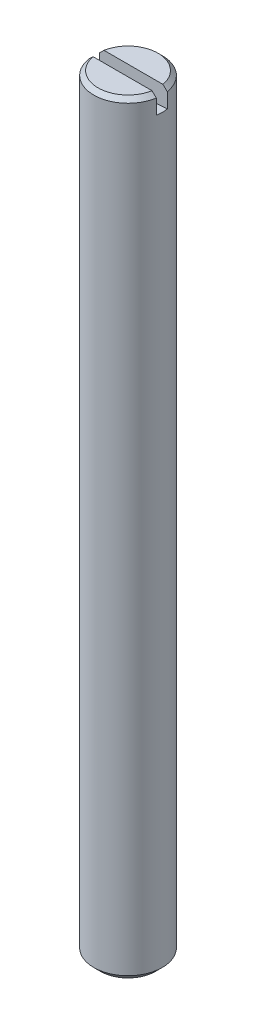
ISO-10303-21;
HEADER;
FILE_DESCRIPTION(('STEP AP214'),'2;1');
FILE_NAME('part.step','',(''),(''),'','','');
FILE_SCHEMA(('AUTOMOTIVE_DESIGN { 1 0 10303 214 1 1 1 1 }'));
ENDSEC;
DATA;
#1=APPLICATION_CONTEXT('core data for automotive mechanical design processes');
#2=APPLICATION_PROTOCOL_DEFINITION('international standard','automotive_design',2000,#1);
#3=PRODUCT_CONTEXT('',#1,'mechanical');
#4=PRODUCT('Part','Part','',(#3));
#5=PRODUCT_RELATED_PRODUCT_CATEGORY('part','',(#4));
#6=PRODUCT_DEFINITION_FORMATION('','',#4);
#7=PRODUCT_DEFINITION_CONTEXT('part definition',#1,'design');
#8=PRODUCT_DEFINITION('design','',#6,#7);
#9=PRODUCT_DEFINITION_SHAPE('','',#8);
#10=(LENGTH_UNIT() NAMED_UNIT(*) SI_UNIT(.MILLI.,.METRE.));
#11=(NAMED_UNIT(*) PLANE_ANGLE_UNIT() SI_UNIT($,.RADIAN.));
#12=(NAMED_UNIT(*) SI_UNIT($,.STERADIAN.) SOLID_ANGLE_UNIT());
#13=UNCERTAINTY_MEASURE_WITH_UNIT(LENGTH_MEASURE(1.E-05),#10,'distance_accuracy_value','');
#14=(GEOMETRIC_REPRESENTATION_CONTEXT(3) GLOBAL_UNCERTAINTY_ASSIGNED_CONTEXT((#13)) GLOBAL_UNIT_ASSIGNED_CONTEXT((#10,
#11,#12)) REPRESENTATION_CONTEXT('',''));
#15=CARTESIAN_POINT('',(0.,0.,0.));
#16=DIRECTION('',(0.,0.,1.));
#17=DIRECTION('',(1.,0.,0.));
#18=AXIS2_PLACEMENT_3D('',#15,#16,#17);
#19=CARTESIAN_POINT('',(0.,36.,0.));
#20=DIRECTION('',(0.,-1.,0.));
#21=DIRECTION('',(0.,0.,-1.));
#22=AXIS2_PLACEMENT_3D('',#19,#20,#21);
#23=PLANE('',#22);
#24=CARTESIAN_POINT('',(0.,36.0000000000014,0.));
#25=DIRECTION('',(0.,-1.,0.));
#26=DIRECTION('',(0.,0.,-1.));
#27=AXIS2_PLACEMENT_3D('',#24,#25,#26);
#28=CIRCLE('',#27,2.19349999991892);
#29=CARTESIAN_POINT('',(-2.15672025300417,35.9999999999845,-0.4));
#30=VERTEX_POINT('',#29);
#31=CARTESIAN_POINT('',(2.15672025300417,35.9999999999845,-0.4));
#32=VERTEX_POINT('',#31);
#33=EDGE_CURVE('E166',#30,#32,#28,.T.);
#34=ORIENTED_EDGE('',*,*,#33,.F.);
#35=DIRECTION('',(1.,0.,0.));
#36=VECTOR('',#35,1.);
#37=CARTESIAN_POINT('',(0.,36.,-0.4));
#38=LINE('',#37,#36);
#39=EDGE_CURVE('E164',#32,#30,#38,.F.);
#40=ORIENTED_EDGE('',*,*,#39,.F.);
#41=EDGE_LOOP('',(#34,#40));
#42=FACE_BOUND('',#41,.T.);
#43=ADVANCED_FACE('F15',(#42),#23,.F.);
#44=CARTESIAN_POINT('',(0.,36.,0.));
#45=DIRECTION('',(0.,-1.,0.));
#46=DIRECTION('',(0.,0.,-1.));
#47=AXIS2_PLACEMENT_3D('',#44,#45,#46);
#48=PLANE('',#47);
#49=DIRECTION('',(1.,0.,0.));
#50=VECTOR('',#49,1.);
#51=CARTESIAN_POINT('',(0.,36.,0.4));
#52=LINE('',#51,#50);
#53=CARTESIAN_POINT('',(-2.15672025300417,35.9999999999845,0.4));
#54=VERTEX_POINT('',#53);
#55=CARTESIAN_POINT('',(2.15672025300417,35.9999999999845,0.4));
#56=VERTEX_POINT('',#55);
#57=EDGE_CURVE('E162',#54,#56,#52,.T.);
#58=ORIENTED_EDGE('',*,*,#57,.F.);
#59=CARTESIAN_POINT('',(0.,36.0000000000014,0.));
#60=DIRECTION('',(0.,-1.,0.));
#61=DIRECTION('',(0.,0.,-1.));
#62=AXIS2_PLACEMENT_3D('',#59,#60,#61);
#63=CIRCLE('',#62,2.19349999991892);
#64=EDGE_CURVE('E160',#56,#54,#63,.T.);
#65=ORIENTED_EDGE('',*,*,#64,.F.);
#66=EDGE_LOOP('',(#58,#65));
#67=FACE_BOUND('',#66,.T.);
#68=ADVANCED_FACE('F122',(#67),#48,.F.);
#69=CARTESIAN_POINT('',(0.,35.6934999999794,0.));
#70=DIRECTION('',(0.,-1.,0.));
#71=DIRECTION('',(0.,0.,-1.));
#72=AXIS2_PLACEMENT_3D('',#69,#70,#71);
#73=CONICAL_SURFACE('',#72,2.49999999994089,0.785398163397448);
#74=CARTESIAN_POINT('',(-2.15672025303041,35.9999999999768,-0.400000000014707));
#75=CARTESIAN_POINT('',(-2.20861576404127,35.9489675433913,-0.400000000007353));
#76=CARTESIAN_POINT('',(-2.26048621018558,35.8979096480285,-0.400000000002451));
#77=CARTESIAN_POINT('',(-2.36417697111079,35.7957429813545,-0.399999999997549));
#78=CARTESIAN_POINT('',(-2.41599728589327,35.7446342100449,-0.399999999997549));
#79=CARTESIAN_POINT('',(-2.46779253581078,35.6934999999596,-0.4));
#80=B_SPLINE_CURVE_WITH_KNOTS('',3,(#74,#75,#76,#77,#78,#79),.UNSPECIFIED.,.F.,.F.,(4,2,4),(0.,
0.218350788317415,0.436701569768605),.UNSPECIFIED.);
#81=CARTESIAN_POINT('',(-2.46779253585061,35.6934999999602,-0.4));
#82=VERTEX_POINT('',#81);
#83=EDGE_CURVE('E40',#30,#82,#80,.T.);
#84=ORIENTED_EDGE('',*,*,#83,.F.);
#85=ORIENTED_EDGE('',*,*,#33,.T.);
#86=CARTESIAN_POINT('',(2.46779253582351,35.6934999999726,-0.400000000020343));
#87=CARTESIAN_POINT('',(2.41599728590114,35.7446342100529,-0.400000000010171));
#88=CARTESIAN_POINT('',(2.36417697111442,35.7957429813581,-0.400000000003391));
#89=CARTESIAN_POINT('',(2.26048621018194,35.8979096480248,-0.39999999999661));
#90=CARTESIAN_POINT('',(2.20861576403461,35.9489675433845,-0.39999999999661));
#91=CARTESIAN_POINT('',(2.15672025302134,35.9999999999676,-0.4));
#92=B_SPLINE_CURVE_WITH_KNOTS('',3,(#86,#87,#88,#89,#90,#91),.UNSPECIFIED.,.F.,.F.,(4,2,4),(0.,
0.218350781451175,0.436701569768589),.UNSPECIFIED.);
#93=CARTESIAN_POINT('',(2.46779253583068,35.6934999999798,-0.4));
#94=VERTEX_POINT('',#93);
#95=EDGE_CURVE('E135',#94,#32,#92,.T.);
#96=ORIENTED_EDGE('',*,*,#95,.F.);
#97=CARTESIAN_POINT('',(0.,35.6935,0.));
#98=DIRECTION('',(0.,-1.,0.));
#99=DIRECTION('',(0.,0.,-1.));
#100=AXIS2_PLACEMENT_3D('',#97,#98,#99);
#101=CIRCLE('',#100,2.5);
#102=EDGE_CURVE('E10',#82,#94,#101,.T.);
#103=ORIENTED_EDGE('',*,*,#102,.F.);
#104=EDGE_LOOP('',(#84,#85,#96,#103));
#105=FACE_BOUND('',#104,.T.);
#106=ADVANCED_FACE('F117',(#105),#73,.T.);
#107=CARTESIAN_POINT('',(0.,66.,-0.4));
#108=DIRECTION('',(0.,0.,1.));
#109=DIRECTION('',(1.,0.,0.));
#110=AXIS2_PLACEMENT_3D('',#107,#108,#109);
#111=PLANE('',#110);
#112=ORIENTED_EDGE('',*,*,#39,.T.);
#113=ORIENTED_EDGE('',*,*,#83,.T.);
#114=DIRECTION('',(0.,1.,0.));
#115=VECTOR('',#114,1.);
#116=CARTESIAN_POINT('',(-2.46779253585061,66.,-0.4));
#117=LINE('',#116,#115);
#118=CARTESIAN_POINT('',(-2.46779253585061,34.596815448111,-0.4));
#119=VERTEX_POINT('',#118);
#120=EDGE_CURVE('E155',#82,#119,#117,.F.);
#121=ORIENTED_EDGE('',*,*,#120,.T.);
#122=CARTESIAN_POINT('',(0.,66.,-0.4));
#123=DIRECTION('',(0.,0.,-1.));
#124=DIRECTION('',(-1.,0.,0.));
#125=AXIS2_PLACEMENT_3D('',#122,#123,#124);
#126=CIRCLE('',#125,31.5);
#127=CARTESIAN_POINT('',(2.46779253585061,34.596815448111,-0.4));
#128=VERTEX_POINT('',#127);
#129=EDGE_CURVE('E89',#119,#128,#126,.F.);
#130=ORIENTED_EDGE('',*,*,#129,.T.);
#131=DIRECTION('',(0.,1.,0.));
#132=VECTOR('',#131,1.);
#133=CARTESIAN_POINT('',(2.46779253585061,66.,-0.4));
#134=LINE('',#133,#132);
#135=EDGE_CURVE('E141',#128,#94,#134,.T.);
#136=ORIENTED_EDGE('',*,*,#135,.T.);
#137=ORIENTED_EDGE('',*,*,#95,.T.);
#138=EDGE_LOOP('',(#112,#113,#121,#130,#136,#137));
#139=FACE_BOUND('',#138,.T.);
#140=ADVANCED_FACE('F121',(#139),#111,.T.);
#141=CARTESIAN_POINT('',(0.,35.6934999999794,0.));
#142=DIRECTION('',(0.,-1.,0.));
#143=DIRECTION('',(0.,0.,-1.));
#144=AXIS2_PLACEMENT_3D('',#141,#142,#143);
#145=CONICAL_SURFACE('',#144,2.49999999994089,0.785398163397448);
#146=ORIENTED_EDGE('',*,*,#64,.T.);
#147=CARTESIAN_POINT('',(-2.15672025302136,35.9999999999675,0.4));
#148=CARTESIAN_POINT('',(-2.20861576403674,35.9489675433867,0.4));
#149=CARTESIAN_POINT('',(-2.26048621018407,35.8979096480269,0.4));
#150=CARTESIAN_POINT('',(-2.36417697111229,35.795742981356,0.4));
#151=CARTESIAN_POINT('',(-2.41599728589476,35.7446342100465,0.4));
#152=CARTESIAN_POINT('',(-2.46779253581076,35.6934999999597,0.4));
#153=B_SPLINE_CURVE_WITH_KNOTS('',3,(#147,#148,#149,#150,#151,#152),.UNSPECIFIED.,.F.,.F.,(4,2,
4),(0.,0.218350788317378,0.436701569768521),.UNSPECIFIED.);
#154=CARTESIAN_POINT('',(-2.46779253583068,35.6934999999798,0.4));
#155=VERTEX_POINT('',#154);
#156=EDGE_CURVE('E150',#54,#155,#153,.T.);
#157=ORIENTED_EDGE('',*,*,#156,.T.);
#158=CARTESIAN_POINT('',(0.,35.6935,0.));
#159=DIRECTION('',(0.,-1.,0.));
#160=DIRECTION('',(0.,0.,-1.));
#161=AXIS2_PLACEMENT_3D('',#158,#159,#160);
#162=CIRCLE('',#161,2.5);
#163=CARTESIAN_POINT('',(2.46779253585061,35.6934999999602,0.4));
#164=VERTEX_POINT('',#163);
#165=EDGE_CURVE('E31',#164,#155,#162,.T.);
#166=ORIENTED_EDGE('',*,*,#165,.F.);
#167=CARTESIAN_POINT('',(2.46779253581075,35.6934999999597,0.4));
#168=CARTESIAN_POINT('',(2.41599728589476,35.7446342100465,0.4));
#169=CARTESIAN_POINT('',(2.36417697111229,35.795742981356,0.4));
#170=CARTESIAN_POINT('',(2.26048621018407,35.8979096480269,0.4));
#171=CARTESIAN_POINT('',(2.20861576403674,35.9489675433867,0.4));
#172=CARTESIAN_POINT('',(2.15672025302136,35.9999999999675,0.4));
#173=B_SPLINE_CURVE_WITH_KNOTS('',3,(#167,#168,#169,#170,#171,#172),.UNSPECIFIED.,.F.,.F.,(4,2,
4),(0.,0.218350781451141,0.436701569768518),.UNSPECIFIED.);
#174=EDGE_CURVE('E97',#164,#56,#173,.T.);
#175=ORIENTED_EDGE('',*,*,#174,.T.);
#176=EDGE_LOOP('',(#146,#157,#166,#175));
#177=FACE_BOUND('',#176,.T.);
#178=ADVANCED_FACE('F123',(#177),#145,.T.);
#179=CARTESIAN_POINT('',(0.,66.,0.4));
#180=DIRECTION('',(0.,0.,1.));
#181=DIRECTION('',(1.,0.,0.));
#182=AXIS2_PLACEMENT_3D('',#179,#180,#181);
#183=PLANE('',#182);
#184=ORIENTED_EDGE('',*,*,#57,.T.);
#185=ORIENTED_EDGE('',*,*,#174,.F.);
#186=DIRECTION('',(0.,1.,0.));
#187=VECTOR('',#186,1.);
#188=CARTESIAN_POINT('',(2.46779253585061,66.,0.4));
#189=LINE('',#188,#187);
#190=CARTESIAN_POINT('',(2.46779253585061,34.596815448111,0.4));
#191=VERTEX_POINT('',#190);
#192=EDGE_CURVE('E95',#191,#164,#189,.T.);
#193=ORIENTED_EDGE('',*,*,#192,.F.);
#194=CARTESIAN_POINT('',(0.,66.,0.4));
#195=DIRECTION('',(0.,0.,-1.));
#196=DIRECTION('',(-1.,0.,0.));
#197=AXIS2_PLACEMENT_3D('',#194,#195,#196);
#198=CIRCLE('',#197,31.5);
#199=CARTESIAN_POINT('',(-2.46779253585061,34.596815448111,0.4));
#200=VERTEX_POINT('',#199);
#201=EDGE_CURVE('E82',#200,#191,#198,.F.);
#202=ORIENTED_EDGE('',*,*,#201,.F.);
#203=DIRECTION('',(0.,1.,0.));
#204=VECTOR('',#203,1.);
#205=CARTESIAN_POINT('',(-2.46779253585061,66.,0.4));
#206=LINE('',#205,#204);
#207=EDGE_CURVE('E74',#155,#200,#206,.F.);
#208=ORIENTED_EDGE('',*,*,#207,.F.);
#209=ORIENTED_EDGE('',*,*,#156,.F.);
#210=EDGE_LOOP('',(#184,#185,#193,#202,#208,#209));
#211=FACE_BOUND('',#210,.T.);
#212=ADVANCED_FACE('F93',(#211),#183,.F.);
#213=CARTESIAN_POINT('',(0.,66.,0.4));
#214=DIRECTION('',(0.,0.,-1.));
#215=DIRECTION('',(-1.,0.,0.));
#216=AXIS2_PLACEMENT_3D('',#213,#214,#215);
#217=CYLINDRICAL_SURFACE('',#216,31.5);
#218=CARTESIAN_POINT('',(2.46779253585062,34.596815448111,-0.4));
#219=CARTESIAN_POINT('',(2.47854531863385,34.5976618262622,-0.333698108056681));
#220=CARTESIAN_POINT('',(2.48661458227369,34.598300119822,-0.266959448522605));
#221=CARTESIAN_POINT('',(2.49732458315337,34.5991493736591,-0.133478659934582));
#222=CARTESIAN_POINT('',(2.5,34.5993630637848,-0.066739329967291));
#223=CARTESIAN_POINT('',(2.5,34.5993630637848,0.066739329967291));
#224=CARTESIAN_POINT('',(2.49732458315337,34.5991493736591,0.133478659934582));
#225=CARTESIAN_POINT('',(2.48661458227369,34.598300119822,0.266959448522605));
#226=CARTESIAN_POINT('',(2.47854531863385,34.5976618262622,0.333698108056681));
#227=CARTESIAN_POINT('',(2.46779253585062,34.596815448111,0.4));
#228=B_SPLINE_CURVE_WITH_KNOTS('',3,(#218,#219,#220,#221,#222,#223,#224,#225,#226,#227),
.UNSPECIFIED.,.F.,.F.,(4,2,2,2,4),(0.,0.201464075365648,0.401628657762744,0.601793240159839,
0.803257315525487),.UNSPECIFIED.);
#229=EDGE_CURVE('E83',#128,#191,#228,.T.);
#230=ORIENTED_EDGE('',*,*,#229,.F.);
#231=ORIENTED_EDGE('',*,*,#129,.F.);
#232=CARTESIAN_POINT('',(-2.46779253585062,34.596815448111,0.4));
#233=CARTESIAN_POINT('',(-2.47854531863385,34.5976618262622,0.333698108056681));
#234=CARTESIAN_POINT('',(-2.48661458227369,34.598300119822,0.266959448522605));
#235=CARTESIAN_POINT('',(-2.49732458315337,34.5991493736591,0.133478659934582));
#236=CARTESIAN_POINT('',(-2.5,34.5993630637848,0.066739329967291));
#237=CARTESIAN_POINT('',(-2.5,34.5993630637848,-0.066739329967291));
#238=CARTESIAN_POINT('',(-2.49732458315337,34.5991493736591,-0.133478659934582));
#239=CARTESIAN_POINT('',(-2.48661458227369,34.598300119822,-0.266959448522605));
#240=CARTESIAN_POINT('',(-2.47854531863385,34.5976618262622,-0.333698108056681));
#241=CARTESIAN_POINT('',(-2.46779253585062,34.596815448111,-0.4));
#242=B_SPLINE_CURVE_WITH_KNOTS('',3,(#232,#233,#234,#235,#236,#237,#238,#239,#240,#241),
.UNSPECIFIED.,.F.,.F.,(4,2,2,2,4),(0.,0.201464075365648,0.401628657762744,0.601793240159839,
0.803257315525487),.UNSPECIFIED.);
#243=EDGE_CURVE('E20',#200,#119,#242,.T.);
#244=ORIENTED_EDGE('',*,*,#243,.F.);
#245=ORIENTED_EDGE('',*,*,#201,.T.);
#246=EDGE_LOOP('',(#230,#231,#244,#245));
#247=FACE_BOUND('',#246,.T.);
#248=ADVANCED_FACE('F17',(#247),#217,.F.);
#249=CARTESIAN_POINT('',(0.,26.5,0.));
#250=DIRECTION('',(0.,-1.,0.));
#251=DIRECTION('',(0.,0.,-1.));
#252=AXIS2_PLACEMENT_3D('',#249,#250,#251);
#253=CYLINDRICAL_SURFACE('',#252,2.5);
#254=ORIENTED_EDGE('',*,*,#229,.T.);
#255=ORIENTED_EDGE('',*,*,#192,.T.);
#256=ORIENTED_EDGE('',*,*,#165,.T.);
#257=ORIENTED_EDGE('',*,*,#207,.T.);
#258=ORIENTED_EDGE('',*,*,#243,.T.);
#259=ORIENTED_EDGE('',*,*,#120,.F.);
#260=ORIENTED_EDGE('',*,*,#102,.T.);
#261=ORIENTED_EDGE('',*,*,#135,.F.);
#262=EDGE_LOOP('',(#254,#255,#256,#257,#258,#259,#260,#261));
#263=FACE_BOUND('',#262,.T.);
#264=CARTESIAN_POINT('',(0.,-19.5095,0.));
#265=DIRECTION('',(0.,-1.,0.));
#266=DIRECTION('',(0.,0.,-1.));
#267=AXIS2_PLACEMENT_3D('',#264,#265,#266);
#268=CIRCLE('',#267,2.5);
#269=CARTESIAN_POINT('',(0.,-19.5095,-2.5));
#270=VERTEX_POINT('',#269);
#271=EDGE_CURVE('E173',#270,#270,#268,.F.);
#272=ORIENTED_EDGE('',*,*,#271,.T.);
#273=EDGE_LOOP('',(#272));
#274=FACE_BOUND('',#273,.T.);
#275=ADVANCED_FACE('F76',(#263,#274),#253,.T.);
#276=CARTESIAN_POINT('',(2.0095,-20.,0.));
#277=DIRECTION('',(0.,1.,0.));
#278=DIRECTION('',(0.,0.,1.));
#279=AXIS2_PLACEMENT_3D('',#276,#277,#278);
#280=PLANE('',#279);
#281=CARTESIAN_POINT('',(0.,-20.0000000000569,0.));
#282=DIRECTION('',(0.,1.,0.));
#283=DIRECTION('',(0.,0.,1.));
#284=AXIS2_PLACEMENT_3D('',#281,#282,#283);
#285=CIRCLE('',#284,2.00949999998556);
#286=CARTESIAN_POINT('',(0.,-20.0000000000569,2.00949999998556));
#287=VERTEX_POINT('',#286);
#288=EDGE_CURVE('E91',#287,#287,#285,.T.);
#289=ORIENTED_EDGE('',*,*,#288,.F.);
#290=EDGE_LOOP('',(#289));
#291=FACE_BOUND('',#290,.T.);
#292=ADVANCED_FACE('F114',(#291),#280,.F.);
#293=CARTESIAN_POINT('',(0.,-19.5094999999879,0.));
#294=DIRECTION('',(0.,1.,0.));
#295=DIRECTION('',(0.,0.,1.));
#296=AXIS2_PLACEMENT_3D('',#293,#294,#295);
#297=CONICAL_SURFACE('',#296,2.50000000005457,0.785398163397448);
#298=ORIENTED_EDGE('',*,*,#271,.F.);
#299=EDGE_LOOP('',(#298));
#300=FACE_BOUND('',#299,.T.);
#301=ORIENTED_EDGE('',*,*,#288,.T.);
#302=EDGE_LOOP('',(#301));
#303=FACE_BOUND('',#302,.T.);
#304=ADVANCED_FACE('F115',(#300,#303),#297,.T.);
#305=CLOSED_SHELL('',(#43,#68,#106,#140,#178,#212,#248,#275,#292,#304));
#306=MANIFOLD_SOLID_BREP('B1',#305);
#307=ADVANCED_BREP_SHAPE_REPRESENTATION('',(#18,#306),#14);
#308=SHAPE_DEFINITION_REPRESENTATION(#9,#307);
ENDSEC;
END-ISO-10303-21;
